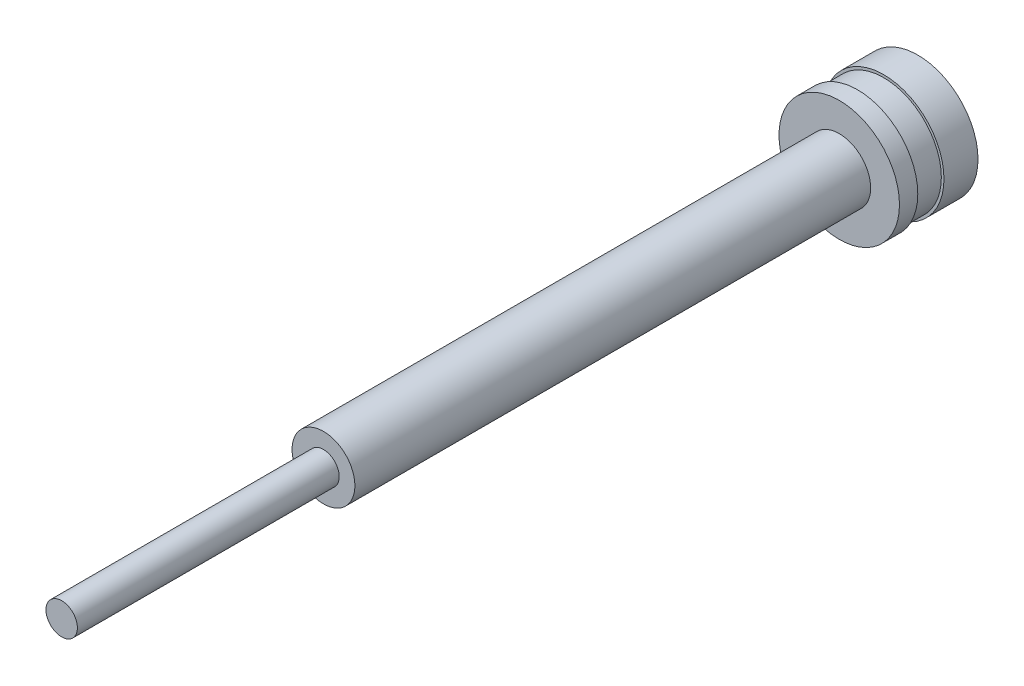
ISO-10303-21;
HEADER;
FILE_DESCRIPTION(('STEP AP214'),'2;1');
FILE_NAME('part.step','',(''),(''),'','','');
FILE_SCHEMA(('AUTOMOTIVE_DESIGN { 1 0 10303 214 1 1 1 1 }'));
ENDSEC;
DATA;
#1=APPLICATION_CONTEXT('core data for automotive mechanical design processes');
#2=APPLICATION_PROTOCOL_DEFINITION('international standard','automotive_design',2000,#1);
#3=PRODUCT_CONTEXT('',#1,'mechanical');
#4=PRODUCT('Part','Part','',(#3));
#5=PRODUCT_RELATED_PRODUCT_CATEGORY('part','',(#4));
#6=PRODUCT_DEFINITION_FORMATION('','',#4);
#7=PRODUCT_DEFINITION_CONTEXT('part definition',#1,'design');
#8=PRODUCT_DEFINITION('design','',#6,#7);
#9=PRODUCT_DEFINITION_SHAPE('','',#8);
#10=(LENGTH_UNIT() NAMED_UNIT(*) SI_UNIT(.MILLI.,.METRE.));
#11=(NAMED_UNIT(*) PLANE_ANGLE_UNIT() SI_UNIT($,.RADIAN.));
#12=(NAMED_UNIT(*) SI_UNIT($,.STERADIAN.) SOLID_ANGLE_UNIT());
#13=UNCERTAINTY_MEASURE_WITH_UNIT(LENGTH_MEASURE(1.E-05),#10,'distance_accuracy_value','');
#14=(GEOMETRIC_REPRESENTATION_CONTEXT(3) GLOBAL_UNCERTAINTY_ASSIGNED_CONTEXT((#13)) GLOBAL_UNIT_ASSIGNED_CONTEXT((#10,
#11,#12)) REPRESENTATION_CONTEXT('',''));
#15=CARTESIAN_POINT('',(0.,0.,0.));
#16=DIRECTION('',(0.,0.,1.));
#17=DIRECTION('',(1.,0.,0.));
#18=AXIS2_PLACEMENT_3D('',#15,#16,#17);
#19=CARTESIAN_POINT('',(0.,0.,0.));
#20=DIRECTION('',(0.,0.,-0.999999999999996));
#21=DIRECTION('',(-1.,0.,0.));
#22=AXIS2_PLACEMENT_3D('',#19,#20,#21);
#23=PLANE('',#22);
#24=CARTESIAN_POINT('',(0.,0.,0.));
#25=DIRECTION('',(0.,0.,0.999999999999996));
#26=DIRECTION('',(1.,0.,0.));
#27=AXIS2_PLACEMENT_3D('',#24,#25,#26);
#28=CIRCLE('',#27,3.);
#29=CARTESIAN_POINT('',(3.,0.,0.));
#30=VERTEX_POINT('',#29);
#31=EDGE_CURVE('E10',#30,#30,#28,.T.);
#32=ORIENTED_EDGE('',*,*,#31,.T.);
#33=EDGE_LOOP('',(#32));
#34=FACE_BOUND('',#33,.T.);
#35=ADVANCED_FACE('F38',(#34),#23,.F.);
#36=CARTESIAN_POINT('',(0.,0.,41.0720747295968));
#37=DIRECTION('',(0.,0.,0.999999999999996));
#38=DIRECTION('',(1.,0.,0.));
#39=AXIS2_PLACEMENT_3D('',#36,#37,#38);
#40=CYLINDRICAL_SURFACE('',#39,3.);
#41=CARTESIAN_POINT('',(0.,0.,-50.));
#42=DIRECTION('',(0.,0.,0.999999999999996));
#43=DIRECTION('',(1.,0.,0.));
#44=AXIS2_PLACEMENT_3D('',#41,#42,#43);
#45=CIRCLE('',#44,3.);
#46=CARTESIAN_POINT('',(3.,0.,-50.));
#47=VERTEX_POINT('',#46);
#48=EDGE_CURVE('E45',#47,#47,#45,.T.);
#49=CARTESIAN_POINT('',(3.,0.,0.));
#50=CARTESIAN_POINT('',(3.,0.,-0.520833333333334));
#51=CARTESIAN_POINT('',(3.,0.,-1.04166666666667));
#52=CARTESIAN_POINT('',(3.,0.,-2.08333333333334));
#53=CARTESIAN_POINT('',(3.,0.,-2.60416666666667));
#54=CARTESIAN_POINT('',(3.,0.,-3.64583333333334));
#55=CARTESIAN_POINT('',(3.,0.,-4.16666666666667));
#56=CARTESIAN_POINT('',(3.,0.,-5.20833333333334));
#57=CARTESIAN_POINT('',(3.,0.,-5.72916666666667));
#58=CARTESIAN_POINT('',(3.,0.,-6.77083333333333));
#59=CARTESIAN_POINT('',(3.,0.,-7.29166666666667));
#60=CARTESIAN_POINT('',(3.,0.,-8.33333333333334));
#61=CARTESIAN_POINT('',(3.,0.,-8.85416666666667));
#62=CARTESIAN_POINT('',(3.,0.,-9.89583333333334));
#63=CARTESIAN_POINT('',(3.,0.,-10.4166666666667));
#64=CARTESIAN_POINT('',(3.,0.,-11.4583333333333));
#65=CARTESIAN_POINT('',(3.,0.,-11.9791666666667));
#66=CARTESIAN_POINT('',(3.,0.,-13.0208333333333));
#67=CARTESIAN_POINT('',(3.,0.,-13.5416666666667));
#68=CARTESIAN_POINT('',(3.,0.,-14.5833333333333));
#69=CARTESIAN_POINT('',(3.,0.,-15.1041666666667));
#70=CARTESIAN_POINT('',(3.,0.,-16.1458333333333));
#71=CARTESIAN_POINT('',(3.,0.,-16.6666666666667));
#72=CARTESIAN_POINT('',(3.,0.,-17.7083333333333));
#73=CARTESIAN_POINT('',(3.,0.,-18.2291666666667));
#74=CARTESIAN_POINT('',(3.,0.,-19.2708333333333));
#75=CARTESIAN_POINT('',(3.,0.,-19.7916666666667));
#76=CARTESIAN_POINT('',(3.,0.,-20.8333333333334));
#77=CARTESIAN_POINT('',(3.,0.,-21.3541666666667));
#78=CARTESIAN_POINT('',(3.,0.,-22.3958333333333));
#79=CARTESIAN_POINT('',(3.,0.,-22.9166666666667));
#80=CARTESIAN_POINT('',(3.,0.,-23.9583333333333));
#81=CARTESIAN_POINT('',(3.,0.,-24.4791666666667));
#82=CARTESIAN_POINT('',(3.,0.,-25.5208333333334));
#83=CARTESIAN_POINT('',(3.,0.,-26.0416666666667));
#84=CARTESIAN_POINT('',(3.,0.,-27.0833333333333));
#85=CARTESIAN_POINT('',(3.,0.,-27.6041666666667));
#86=CARTESIAN_POINT('',(3.,0.,-28.6458333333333));
#87=CARTESIAN_POINT('',(3.,0.,-29.1666666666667));
#88=CARTESIAN_POINT('',(3.,0.,-30.2083333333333));
#89=CARTESIAN_POINT('',(3.,0.,-30.7291666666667));
#90=CARTESIAN_POINT('',(3.,0.,-31.7708333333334));
#91=CARTESIAN_POINT('',(3.,0.,-32.2916666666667));
#92=CARTESIAN_POINT('',(3.,0.,-33.3333333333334));
#93=CARTESIAN_POINT('',(3.,0.,-33.8541666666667));
#94=CARTESIAN_POINT('',(3.,0.,-34.8958333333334));
#95=CARTESIAN_POINT('',(3.,0.,-35.4166666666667));
#96=CARTESIAN_POINT('',(3.,0.,-36.4583333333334));
#97=CARTESIAN_POINT('',(3.,0.,-36.9791666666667));
#98=CARTESIAN_POINT('',(3.,0.,-38.0208333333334));
#99=CARTESIAN_POINT('',(3.,0.,-38.5416666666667));
#100=CARTESIAN_POINT('',(3.,0.,-39.5833333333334));
#101=CARTESIAN_POINT('',(3.,0.,-40.1041666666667));
#102=CARTESIAN_POINT('',(3.,0.,-41.1458333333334));
#103=CARTESIAN_POINT('',(3.,0.,-41.6666666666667));
#104=CARTESIAN_POINT('',(3.,0.,-42.7083333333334));
#105=CARTESIAN_POINT('',(3.,0.,-43.2291666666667));
#106=CARTESIAN_POINT('',(3.,0.,-44.2708333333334));
#107=CARTESIAN_POINT('',(3.,0.,-44.7916666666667));
#108=CARTESIAN_POINT('',(3.,0.,-45.8333333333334));
#109=CARTESIAN_POINT('',(3.,0.,-46.3541666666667));
#110=CARTESIAN_POINT('',(3.,0.,-47.3958333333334));
#111=CARTESIAN_POINT('',(3.,0.,-47.9166666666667));
#112=CARTESIAN_POINT('',(3.,0.,-48.9583333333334));
#113=CARTESIAN_POINT('',(3.,0.,-49.4791666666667));
#114=CARTESIAN_POINT('',(3.,0.,-50.));
#115=B_SPLINE_CURVE_WITH_KNOTS('',3,(#49,#50,#51,#52,#53,#54,#55,#56,#57,#58,#59,#60,#61,#62,
#63,#64,#65,#66,#67,#68,#69,#70,#71,#72,#73,#74,#75,#76,#77,#78,#79,#80,#81,#82,#83,#84,#85,#86,
#87,#88,#89,#90,#91,#92,#93,#94,#95,#96,#97,#98,#99,#100,#101,#102,#103,#104,#105,#106,#107,
#108,#109,#110,#111,#112,#113,#114),.UNSPECIFIED.,.F.,.F.,(4,2,2,2,2,2,2,2,2,2,2,2,2,2,2,2,2,2,
2,2,2,2,2,2,2,2,2,2,2,2,2,2,4),(0.,1.5625,3.125,4.6875,6.25,7.8125,9.37500000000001,10.9375,
12.5,14.0625,15.625,17.1875,18.75,20.3125,21.875,23.4375,25.,26.5625,28.125,29.6875,31.25,
32.8125,34.375,35.9375,37.5,39.0625,40.625,42.1875,43.75,45.3125,46.875,48.4375,50.),.UNSPECIFIED.);
#116=EDGE_CURVE('BSEAM102',#30,#47,#115,.T.);
#117=ORIENTED_EDGE('',*,*,#31,.F.);
#118=ORIENTED_EDGE('',*,*,#48,.T.);
#119=ORIENTED_EDGE('',*,*,#116,.T.);
#120=ORIENTED_EDGE('',*,*,#116,.F.);
#121=EDGE_LOOP('',(#117,#119,#118,#120));
#122=FACE_BOUND('',#121,.T.);
#123=ADVANCED_FACE('F102',(#122),#40,.T.);
#124=CARTESIAN_POINT('',(0.,3.,-50.));
#125=DIRECTION('',(0.,0.,-0.999999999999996));
#126=DIRECTION('',(-1.,0.,0.));
#127=AXIS2_PLACEMENT_3D('',#124,#125,#126);
#128=PLANE('',#127);
#129=ORIENTED_EDGE('',*,*,#48,.F.);
#130=EDGE_LOOP('',(#129));
#131=FACE_BOUND('',#130,.T.);
#132=CARTESIAN_POINT('',(0.,0.,-50.));
#133=DIRECTION('',(0.,0.,0.999999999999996));
#134=DIRECTION('',(1.,0.,0.));
#135=AXIS2_PLACEMENT_3D('',#132,#133,#134);
#136=CIRCLE('',#135,6.);
#137=CARTESIAN_POINT('',(6.,0.,-50.));
#138=VERTEX_POINT('',#137);
#139=EDGE_CURVE('E52',#138,#138,#136,.T.);
#140=ORIENTED_EDGE('',*,*,#139,.T.);
#141=EDGE_LOOP('',(#140));
#142=FACE_BOUND('',#141,.T.);
#143=ADVANCED_FACE('F106',(#131,#142),#128,.F.);
#144=CARTESIAN_POINT('',(0.,0.,41.0720747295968));
#145=DIRECTION('',(0.,0.,0.999999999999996));
#146=DIRECTION('',(1.,0.,0.));
#147=AXIS2_PLACEMENT_3D('',#144,#145,#146);
#148=CYLINDRICAL_SURFACE('',#147,6.);
#149=CARTESIAN_POINT('',(-9.43689570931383E-13,1.88737914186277E-12,-148.5));
#150=DIRECTION('',(0.,0.,0.999999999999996));
#151=DIRECTION('',(1.,0.,0.));
#152=AXIS2_PLACEMENT_3D('',#149,#150,#151);
#153=CIRCLE('',#152,6.);
#154=CARTESIAN_POINT('',(6.,0.,-148.5));
#155=VERTEX_POINT('',#154);
#156=EDGE_CURVE('E58',#155,#155,#153,.T.);
#157=CARTESIAN_POINT('',(6.,0.,-50.));
#158=CARTESIAN_POINT('',(6.,0.,-51.0260416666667));
#159=CARTESIAN_POINT('',(6.,0.,-52.0520833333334));
#160=CARTESIAN_POINT('',(6.,0.,-54.1041666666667));
#161=CARTESIAN_POINT('',(6.,0.,-55.1302083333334));
#162=CARTESIAN_POINT('',(6.,0.,-57.1822916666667));
#163=CARTESIAN_POINT('',(6.,0.,-58.2083333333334));
#164=CARTESIAN_POINT('',(6.,0.,-60.2604166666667));
#165=CARTESIAN_POINT('',(6.,0.,-61.2864583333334));
#166=CARTESIAN_POINT('',(6.,0.,-63.3385416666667));
#167=CARTESIAN_POINT('',(6.,0.,-64.3645833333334));
#168=CARTESIAN_POINT('',(6.,0.,-66.4166666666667));
#169=CARTESIAN_POINT('',(6.,0.,-67.4427083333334));
#170=CARTESIAN_POINT('',(6.,0.,-69.4947916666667));
#171=CARTESIAN_POINT('',(6.,0.,-70.5208333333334));
#172=CARTESIAN_POINT('',(6.,0.,-72.5729166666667));
#173=CARTESIAN_POINT('',(6.,0.,-73.5989583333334));
#174=CARTESIAN_POINT('',(6.,0.,-75.6510416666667));
#175=CARTESIAN_POINT('',(6.,0.,-76.6770833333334));
#176=CARTESIAN_POINT('',(6.,0.,-78.7291666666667));
#177=CARTESIAN_POINT('',(6.,0.,-79.7552083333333));
#178=CARTESIAN_POINT('',(6.,0.,-81.8072916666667));
#179=CARTESIAN_POINT('',(6.,0.,-82.8333333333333));
#180=CARTESIAN_POINT('',(6.,0.,-84.8854166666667));
#181=CARTESIAN_POINT('',(6.,0.,-85.9114583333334));
#182=CARTESIAN_POINT('',(6.,0.,-87.9635416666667));
#183=CARTESIAN_POINT('',(6.,0.,-88.9895833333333));
#184=CARTESIAN_POINT('',(6.,0.,-91.0416666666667));
#185=CARTESIAN_POINT('',(6.,0.,-92.0677083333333));
#186=CARTESIAN_POINT('',(6.,0.,-94.1197916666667));
#187=CARTESIAN_POINT('',(6.,0.,-95.1458333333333));
#188=CARTESIAN_POINT('',(6.,0.,-97.1979166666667));
#189=CARTESIAN_POINT('',(6.,0.,-98.2239583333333));
#190=CARTESIAN_POINT('',(6.,0.,-100.276041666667));
#191=CARTESIAN_POINT('',(6.,0.,-101.302083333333));
#192=CARTESIAN_POINT('',(6.,0.,-103.354166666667));
#193=CARTESIAN_POINT('',(6.,0.,-104.380208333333));
#194=CARTESIAN_POINT('',(6.,0.,-106.432291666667));
#195=CARTESIAN_POINT('',(6.,0.,-107.458333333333));
#196=CARTESIAN_POINT('',(6.,0.,-109.510416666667));
#197=CARTESIAN_POINT('',(6.,0.,-110.536458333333));
#198=CARTESIAN_POINT('',(6.,0.,-112.588541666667));
#199=CARTESIAN_POINT('',(6.,0.,-113.614583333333));
#200=CARTESIAN_POINT('',(6.,0.,-115.666666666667));
#201=CARTESIAN_POINT('',(6.,0.,-116.692708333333));
#202=CARTESIAN_POINT('',(6.,0.,-118.744791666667));
#203=CARTESIAN_POINT('',(6.,0.,-119.770833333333));
#204=CARTESIAN_POINT('',(6.,0.,-121.822916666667));
#205=CARTESIAN_POINT('',(6.,0.,-122.848958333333));
#206=CARTESIAN_POINT('',(6.,0.,-124.901041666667));
#207=CARTESIAN_POINT('',(6.,0.,-125.927083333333));
#208=CARTESIAN_POINT('',(6.,0.,-127.979166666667));
#209=CARTESIAN_POINT('',(6.,0.,-129.005208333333));
#210=CARTESIAN_POINT('',(6.,0.,-131.057291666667));
#211=CARTESIAN_POINT('',(6.,0.,-132.083333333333));
#212=CARTESIAN_POINT('',(6.,0.,-134.135416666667));
#213=CARTESIAN_POINT('',(6.,0.,-135.161458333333));
#214=CARTESIAN_POINT('',(6.,0.,-137.213541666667));
#215=CARTESIAN_POINT('',(6.,0.,-138.239583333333));
#216=CARTESIAN_POINT('',(6.,0.,-140.291666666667));
#217=CARTESIAN_POINT('',(6.,0.,-141.317708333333));
#218=CARTESIAN_POINT('',(6.,0.,-143.369791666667));
#219=CARTESIAN_POINT('',(6.,0.,-144.395833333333));
#220=CARTESIAN_POINT('',(6.,0.,-146.447916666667));
#221=CARTESIAN_POINT('',(6.,0.,-147.473958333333));
#222=CARTESIAN_POINT('',(6.,0.,-148.5));
#223=B_SPLINE_CURVE_WITH_KNOTS('',3,(#157,#158,#159,#160,#161,#162,#163,#164,#165,#166,#167,
#168,#169,#170,#171,#172,#173,#174,#175,#176,#177,#178,#179,#180,#181,#182,#183,#184,#185,#186,
#187,#188,#189,#190,#191,#192,#193,#194,#195,#196,#197,#198,#199,#200,#201,#202,#203,#204,#205,
#206,#207,#208,#209,#210,#211,#212,#213,#214,#215,#216,#217,#218,#219,#220,#221,#222),
.UNSPECIFIED.,.F.,.F.,(4,2,2,2,2,2,2,2,2,2,2,2,2,2,2,2,2,2,2,2,2,2,2,2,2,2,2,2,2,2,2,2,4),(0.,
3.078125,6.15625,9.234375,12.3125,15.390625,18.46875,21.546875,24.625,27.703125,30.78125,
33.859375,36.9375,40.015625,43.09375,46.171875,49.25,52.328125,55.40625,58.484375,61.5625,
64.640625,67.71875,70.7968749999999,73.875,76.9531249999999,80.03125,83.1093749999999,86.1875,
89.2656249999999,92.3437499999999,95.4218749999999,98.4999999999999),.UNSPECIFIED.);
#224=EDGE_CURVE('BSEAM111',#138,#155,#223,.T.);
#225=ORIENTED_EDGE('',*,*,#139,.F.);
#226=ORIENTED_EDGE('',*,*,#156,.T.);
#227=ORIENTED_EDGE('',*,*,#224,.T.);
#228=ORIENTED_EDGE('',*,*,#224,.F.);
#229=EDGE_LOOP('',(#225,#227,#226,#228));
#230=FACE_BOUND('',#229,.T.);
#231=ADVANCED_FACE('F111',(#230),#148,.T.);
#232=CARTESIAN_POINT('',(-9.43689570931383E-13,6.00000000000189,-148.5));
#233=DIRECTION('',(0.,0.,-0.999999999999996));
#234=DIRECTION('',(-1.,0.,0.));
#235=AXIS2_PLACEMENT_3D('',#232,#233,#234);
#236=PLANE('',#235);
#237=ORIENTED_EDGE('',*,*,#156,.F.);
#238=EDGE_LOOP('',(#237));
#239=FACE_BOUND('',#238,.T.);
#240=CARTESIAN_POINT('',(-9.43689570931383E-13,1.88737914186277E-12,-148.5));
#241=DIRECTION('',(0.,0.,0.999999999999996));
#242=DIRECTION('',(1.,0.,0.));
#243=AXIS2_PLACEMENT_3D('',#240,#241,#242);
#244=CIRCLE('',#243,11.5);
#245=CARTESIAN_POINT('',(11.5,0.,-148.5));
#246=VERTEX_POINT('',#245);
#247=EDGE_CURVE('E64',#246,#246,#244,.T.);
#248=ORIENTED_EDGE('',*,*,#247,.T.);
#249=EDGE_LOOP('',(#248));
#250=FACE_BOUND('',#249,.T.);
#251=ADVANCED_FACE('F117',(#239,#250),#236,.F.);
#252=CARTESIAN_POINT('',(0.,0.,41.0720747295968));
#253=DIRECTION('',(0.,0.,0.999999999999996));
#254=DIRECTION('',(1.,0.,0.));
#255=AXIS2_PLACEMENT_3D('',#252,#253,#254);
#256=CYLINDRICAL_SURFACE('',#255,11.5);
#257=CARTESIAN_POINT('',(0.,1.88737914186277E-12,-152.));
#258=DIRECTION('',(0.,0.,0.999999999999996));
#259=DIRECTION('',(1.,0.,0.));
#260=AXIS2_PLACEMENT_3D('',#257,#258,#259);
#261=CIRCLE('',#260,11.5);
#262=CARTESIAN_POINT('',(11.5,0.,-152.));
#263=VERTEX_POINT('',#262);
#264=EDGE_CURVE('E68',#263,#263,#261,.T.);
#265=CARTESIAN_POINT('',(11.5,0.,-148.5));
#266=CARTESIAN_POINT('',(11.5,0.,-148.536458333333));
#267=CARTESIAN_POINT('',(11.5,0.,-148.572916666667));
#268=CARTESIAN_POINT('',(11.5,0.,-148.645833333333));
#269=CARTESIAN_POINT('',(11.5,0.,-148.682291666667));
#270=CARTESIAN_POINT('',(11.5,0.,-148.755208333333));
#271=CARTESIAN_POINT('',(11.5,0.,-148.791666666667));
#272=CARTESIAN_POINT('',(11.5,0.,-148.864583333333));
#273=CARTESIAN_POINT('',(11.5,0.,-148.901041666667));
#274=CARTESIAN_POINT('',(11.5,0.,-148.973958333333));
#275=CARTESIAN_POINT('',(11.5,0.,-149.010416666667));
#276=CARTESIAN_POINT('',(11.5,0.,-149.083333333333));
#277=CARTESIAN_POINT('',(11.5,0.,-149.119791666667));
#278=CARTESIAN_POINT('',(11.5,0.,-149.192708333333));
#279=CARTESIAN_POINT('',(11.5,0.,-149.229166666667));
#280=CARTESIAN_POINT('',(11.5,0.,-149.302083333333));
#281=CARTESIAN_POINT('',(11.5,0.,-149.338541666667));
#282=CARTESIAN_POINT('',(11.5,0.,-149.411458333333));
#283=CARTESIAN_POINT('',(11.5,0.,-149.447916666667));
#284=CARTESIAN_POINT('',(11.5,0.,-149.520833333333));
#285=CARTESIAN_POINT('',(11.5,0.,-149.557291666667));
#286=CARTESIAN_POINT('',(11.5,0.,-149.630208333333));
#287=CARTESIAN_POINT('',(11.5,0.,-149.666666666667));
#288=CARTESIAN_POINT('',(11.5,0.,-149.739583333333));
#289=CARTESIAN_POINT('',(11.5,0.,-149.776041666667));
#290=CARTESIAN_POINT('',(11.5,0.,-149.848958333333));
#291=CARTESIAN_POINT('',(11.5,0.,-149.885416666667));
#292=CARTESIAN_POINT('',(11.5,0.,-149.958333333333));
#293=CARTESIAN_POINT('',(11.5,0.,-149.994791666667));
#294=CARTESIAN_POINT('',(11.5,0.,-150.067708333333));
#295=CARTESIAN_POINT('',(11.5,0.,-150.104166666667));
#296=CARTESIAN_POINT('',(11.5,0.,-150.177083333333));
#297=CARTESIAN_POINT('',(11.5,0.,-150.213541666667));
#298=CARTESIAN_POINT('',(11.5,0.,-150.286458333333));
#299=CARTESIAN_POINT('',(11.5,0.,-150.322916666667));
#300=CARTESIAN_POINT('',(11.5,0.,-150.395833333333));
#301=CARTESIAN_POINT('',(11.5,0.,-150.432291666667));
#302=CARTESIAN_POINT('',(11.5,0.,-150.505208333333));
#303=CARTESIAN_POINT('',(11.5,0.,-150.541666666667));
#304=CARTESIAN_POINT('',(11.5,0.,-150.614583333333));
#305=CARTESIAN_POINT('',(11.5,0.,-150.651041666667));
#306=CARTESIAN_POINT('',(11.5,0.,-150.723958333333));
#307=CARTESIAN_POINT('',(11.5,0.,-150.760416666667));
#308=CARTESIAN_POINT('',(11.5,0.,-150.833333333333));
#309=CARTESIAN_POINT('',(11.5,0.,-150.869791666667));
#310=CARTESIAN_POINT('',(11.5,0.,-150.942708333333));
#311=CARTESIAN_POINT('',(11.5,0.,-150.979166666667));
#312=CARTESIAN_POINT('',(11.5,0.,-151.052083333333));
#313=CARTESIAN_POINT('',(11.5,0.,-151.088541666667));
#314=CARTESIAN_POINT('',(11.5,0.,-151.161458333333));
#315=CARTESIAN_POINT('',(11.5,0.,-151.197916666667));
#316=CARTESIAN_POINT('',(11.5,0.,-151.270833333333));
#317=CARTESIAN_POINT('',(11.5,0.,-151.307291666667));
#318=CARTESIAN_POINT('',(11.5,0.,-151.380208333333));
#319=CARTESIAN_POINT('',(11.5,0.,-151.416666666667));
#320=CARTESIAN_POINT('',(11.5,0.,-151.489583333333));
#321=CARTESIAN_POINT('',(11.5,0.,-151.526041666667));
#322=CARTESIAN_POINT('',(11.5,0.,-151.598958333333));
#323=CARTESIAN_POINT('',(11.5,0.,-151.635416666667));
#324=CARTESIAN_POINT('',(11.5,0.,-151.708333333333));
#325=CARTESIAN_POINT('',(11.5,0.,-151.744791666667));
#326=CARTESIAN_POINT('',(11.5,0.,-151.817708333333));
#327=CARTESIAN_POINT('',(11.5,0.,-151.854166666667));
#328=CARTESIAN_POINT('',(11.5,0.,-151.927083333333));
#329=CARTESIAN_POINT('',(11.5,0.,-151.963541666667));
#330=CARTESIAN_POINT('',(11.5,0.,-152.));
#331=B_SPLINE_CURVE_WITH_KNOTS('',3,(#265,#266,#267,#268,#269,#270,#271,#272,#273,#274,#275,
#276,#277,#278,#279,#280,#281,#282,#283,#284,#285,#286,#287,#288,#289,#290,#291,#292,#293,#294,
#295,#296,#297,#298,#299,#300,#301,#302,#303,#304,#305,#306,#307,#308,#309,#310,#311,#312,#313,
#314,#315,#316,#317,#318,#319,#320,#321,#322,#323,#324,#325,#326,#327,#328,#329,#330),
.UNSPECIFIED.,.F.,.F.,(4,2,2,2,2,2,2,2,2,2,2,2,2,2,2,2,2,2,2,2,2,2,2,2,2,2,2,2,2,2,2,2,4),(0.,
0.109374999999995,0.21874999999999,0.328124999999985,0.43749999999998,0.546875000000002,
0.656249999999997,0.765624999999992,0.874999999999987,0.984374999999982,1.09374999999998,
1.20312499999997,1.31249999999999,1.42187499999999,1.53124999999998,1.64062499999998,
1.74999999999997,1.85937499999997,1.96874999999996,2.07812499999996,2.18749999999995,
2.29687499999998,2.40624999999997,2.51562499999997,2.62499999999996,2.73437499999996,
2.84374999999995,2.95312499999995,3.06249999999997,3.17187499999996,3.28124999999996,
3.39062499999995,3.49999999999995),.UNSPECIFIED.);
#332=EDGE_CURVE('BSEAM121',#246,#263,#331,.T.);
#333=ORIENTED_EDGE('',*,*,#247,.F.);
#334=ORIENTED_EDGE('',*,*,#264,.T.);
#335=ORIENTED_EDGE('',*,*,#332,.T.);
#336=ORIENTED_EDGE('',*,*,#332,.F.);
#337=EDGE_LOOP('',(#333,#335,#334,#336));
#338=FACE_BOUND('',#337,.T.);
#339=ADVANCED_FACE('F121',(#338),#256,.T.);
#340=CARTESIAN_POINT('',(0.,11.5000000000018,-152.));
#341=DIRECTION('',(0.,0.,0.999999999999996));
#342=DIRECTION('',(1.,0.,0.));
#343=AXIS2_PLACEMENT_3D('',#340,#341,#342);
#344=PLANE('',#343);
#345=ORIENTED_EDGE('',*,*,#264,.F.);
#346=EDGE_LOOP('',(#345));
#347=FACE_BOUND('',#346,.T.);
#348=CARTESIAN_POINT('',(0.,1.88737914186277E-12,-152.));
#349=DIRECTION('',(0.,0.,0.999999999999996));
#350=DIRECTION('',(1.,0.,0.));
#351=AXIS2_PLACEMENT_3D('',#348,#349,#350);
#352=CIRCLE('',#351,11.);
#353=CARTESIAN_POINT('',(11.,0.,-152.));
#354=VERTEX_POINT('',#353);
#355=EDGE_CURVE('E72',#354,#354,#352,.T.);
#356=ORIENTED_EDGE('',*,*,#355,.T.);
#357=EDGE_LOOP('',(#356));
#358=FACE_BOUND('',#357,.T.);
#359=ADVANCED_FACE('F125',(#347,#358),#344,.F.);
#360=CARTESIAN_POINT('',(0.,0.,41.0720747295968));
#361=DIRECTION('',(0.,0.,0.999999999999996));
#362=DIRECTION('',(1.,0.,0.));
#363=AXIS2_PLACEMENT_3D('',#360,#361,#362);
#364=CYLINDRICAL_SURFACE('',#363,11.);
#365=CARTESIAN_POINT('',(0.,1.88737914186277E-12,-157.));
#366=DIRECTION('',(0.,0.,0.999999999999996));
#367=DIRECTION('',(1.,0.,0.));
#368=AXIS2_PLACEMENT_3D('',#365,#366,#367);
#369=CIRCLE('',#368,11.);
#370=CARTESIAN_POINT('',(11.,0.,-157.));
#371=VERTEX_POINT('',#370);
#372=EDGE_CURVE('E76',#371,#371,#369,.T.);
#373=CARTESIAN_POINT('',(11.,0.,-152.));
#374=CARTESIAN_POINT('',(11.,0.,-152.052083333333));
#375=CARTESIAN_POINT('',(11.,0.,-152.104166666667));
#376=CARTESIAN_POINT('',(11.,0.,-152.208333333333));
#377=CARTESIAN_POINT('',(11.,0.,-152.260416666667));
#378=CARTESIAN_POINT('',(11.,0.,-152.364583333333));
#379=CARTESIAN_POINT('',(11.,0.,-152.416666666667));
#380=CARTESIAN_POINT('',(11.,0.,-152.520833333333));
#381=CARTESIAN_POINT('',(11.,0.,-152.572916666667));
#382=CARTESIAN_POINT('',(11.,0.,-152.677083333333));
#383=CARTESIAN_POINT('',(11.,0.,-152.729166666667));
#384=CARTESIAN_POINT('',(11.,0.,-152.833333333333));
#385=CARTESIAN_POINT('',(11.,0.,-152.885416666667));
#386=CARTESIAN_POINT('',(11.,0.,-152.989583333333));
#387=CARTESIAN_POINT('',(11.,0.,-153.041666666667));
#388=CARTESIAN_POINT('',(11.,0.,-153.145833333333));
#389=CARTESIAN_POINT('',(11.,0.,-153.197916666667));
#390=CARTESIAN_POINT('',(11.,0.,-153.302083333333));
#391=CARTESIAN_POINT('',(11.,0.,-153.354166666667));
#392=CARTESIAN_POINT('',(11.,0.,-153.458333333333));
#393=CARTESIAN_POINT('',(11.,0.,-153.510416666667));
#394=CARTESIAN_POINT('',(11.,0.,-153.614583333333));
#395=CARTESIAN_POINT('',(11.,0.,-153.666666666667));
#396=CARTESIAN_POINT('',(11.,0.,-153.770833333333));
#397=CARTESIAN_POINT('',(11.,0.,-153.822916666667));
#398=CARTESIAN_POINT('',(11.,0.,-153.927083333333));
#399=CARTESIAN_POINT('',(11.,0.,-153.979166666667));
#400=CARTESIAN_POINT('',(11.,0.,-154.083333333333));
#401=CARTESIAN_POINT('',(11.,0.,-154.135416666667));
#402=CARTESIAN_POINT('',(11.,0.,-154.239583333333));
#403=CARTESIAN_POINT('',(11.,0.,-154.291666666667));
#404=CARTESIAN_POINT('',(11.,0.,-154.395833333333));
#405=CARTESIAN_POINT('',(11.,0.,-154.447916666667));
#406=CARTESIAN_POINT('',(11.,0.,-154.552083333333));
#407=CARTESIAN_POINT('',(11.,0.,-154.604166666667));
#408=CARTESIAN_POINT('',(11.,0.,-154.708333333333));
#409=CARTESIAN_POINT('',(11.,0.,-154.760416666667));
#410=CARTESIAN_POINT('',(11.,0.,-154.864583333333));
#411=CARTESIAN_POINT('',(11.,0.,-154.916666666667));
#412=CARTESIAN_POINT('',(11.,0.,-155.020833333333));
#413=CARTESIAN_POINT('',(11.,0.,-155.072916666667));
#414=CARTESIAN_POINT('',(11.,0.,-155.177083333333));
#415=CARTESIAN_POINT('',(11.,0.,-155.229166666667));
#416=CARTESIAN_POINT('',(11.,0.,-155.333333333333));
#417=CARTESIAN_POINT('',(11.,0.,-155.385416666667));
#418=CARTESIAN_POINT('',(11.,0.,-155.489583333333));
#419=CARTESIAN_POINT('',(11.,0.,-155.541666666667));
#420=CARTESIAN_POINT('',(11.,0.,-155.645833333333));
#421=CARTESIAN_POINT('',(11.,0.,-155.697916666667));
#422=CARTESIAN_POINT('',(11.,0.,-155.802083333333));
#423=CARTESIAN_POINT('',(11.,0.,-155.854166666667));
#424=CARTESIAN_POINT('',(11.,0.,-155.958333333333));
#425=CARTESIAN_POINT('',(11.,0.,-156.010416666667));
#426=CARTESIAN_POINT('',(11.,0.,-156.114583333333));
#427=CARTESIAN_POINT('',(11.,0.,-156.166666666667));
#428=CARTESIAN_POINT('',(11.,0.,-156.270833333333));
#429=CARTESIAN_POINT('',(11.,0.,-156.322916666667));
#430=CARTESIAN_POINT('',(11.,0.,-156.427083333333));
#431=CARTESIAN_POINT('',(11.,0.,-156.479166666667));
#432=CARTESIAN_POINT('',(11.,0.,-156.583333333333));
#433=CARTESIAN_POINT('',(11.,0.,-156.635416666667));
#434=CARTESIAN_POINT('',(11.,0.,-156.739583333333));
#435=CARTESIAN_POINT('',(11.,0.,-156.791666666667));
#436=CARTESIAN_POINT('',(11.,0.,-156.895833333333));
#437=CARTESIAN_POINT('',(11.,0.,-156.947916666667));
#438=CARTESIAN_POINT('',(11.,0.,-157.));
#439=B_SPLINE_CURVE_WITH_KNOTS('',3,(#373,#374,#375,#376,#377,#378,#379,#380,#381,#382,#383,
#384,#385,#386,#387,#388,#389,#390,#391,#392,#393,#394,#395,#396,#397,#398,#399,#400,#401,#402,
#403,#404,#405,#406,#407,#408,#409,#410,#411,#412,#413,#414,#415,#416,#417,#418,#419,#420,#421,
#422,#423,#424,#425,#426,#427,#428,#429,#430,#431,#432,#433,#434,#435,#436,#437,#438),
.UNSPECIFIED.,.F.,.F.,(4,2,2,2,2,2,2,2,2,2,2,2,2,2,2,2,2,2,2,2,2,2,2,2,2,2,2,2,2,2,2,2,4),(0.,
0.156249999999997,0.312499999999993,0.46874999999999,0.624999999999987,0.781250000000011,
0.937500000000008,1.09375,1.25,1.40625,1.56249999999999,1.71874999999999,1.87499999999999,
2.03124999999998,2.18749999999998,2.34374999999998,2.49999999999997,2.65624999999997,
2.81249999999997,2.96874999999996,3.12499999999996,3.28124999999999,3.43749999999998,
3.59374999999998,3.74999999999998,3.90624999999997,4.06249999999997,4.21874999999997,
4.37499999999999,4.53124999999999,4.68749999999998,4.84374999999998,4.99999999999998),.UNSPECIFIED.);
#440=EDGE_CURVE('BSEAM129',#354,#371,#439,.T.);
#441=ORIENTED_EDGE('',*,*,#355,.F.);
#442=ORIENTED_EDGE('',*,*,#372,.T.);
#443=ORIENTED_EDGE('',*,*,#440,.T.);
#444=ORIENTED_EDGE('',*,*,#440,.F.);
#445=EDGE_LOOP('',(#441,#443,#442,#444));
#446=FACE_BOUND('',#445,.T.);
#447=ADVANCED_FACE('F129',(#446),#364,.T.);
#448=CARTESIAN_POINT('',(0.,11.0000000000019,-157.));
#449=DIRECTION('',(0.,0.,-0.999999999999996));
#450=DIRECTION('',(-1.,0.,0.));
#451=AXIS2_PLACEMENT_3D('',#448,#449,#450);
#452=PLANE('',#451);
#453=ORIENTED_EDGE('',*,*,#372,.F.);
#454=EDGE_LOOP('',(#453));
#455=FACE_BOUND('',#454,.T.);
#456=CARTESIAN_POINT('',(0.,1.88737914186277E-12,-157.));
#457=DIRECTION('',(0.,0.,0.999999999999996));
#458=DIRECTION('',(1.,0.,0.));
#459=AXIS2_PLACEMENT_3D('',#456,#457,#458);
#460=CIRCLE('',#459,11.5);
#461=CARTESIAN_POINT('',(11.5,0.,-157.));
#462=VERTEX_POINT('',#461);
#463=EDGE_CURVE('E79',#462,#462,#460,.T.);
#464=ORIENTED_EDGE('',*,*,#463,.T.);
#465=EDGE_LOOP('',(#464));
#466=FACE_BOUND('',#465,.T.);
#467=ADVANCED_FACE('F133',(#455,#466),#452,.F.);
#468=CARTESIAN_POINT('',(0.,0.,41.0720747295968));
#469=DIRECTION('',(0.,0.,0.999999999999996));
#470=DIRECTION('',(1.,0.,0.));
#471=AXIS2_PLACEMENT_3D('',#468,#469,#470);
#472=CYLINDRICAL_SURFACE('',#471,11.5);
#473=CARTESIAN_POINT('',(-9.43689570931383E-13,1.88737914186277E-12,-163.5));
#474=DIRECTION('',(0.,0.,0.999999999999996));
#475=DIRECTION('',(1.,0.,0.));
#476=AXIS2_PLACEMENT_3D('',#473,#474,#475);
#477=CIRCLE('',#476,11.5);
#478=CARTESIAN_POINT('',(11.5,0.,-163.5));
#479=VERTEX_POINT('',#478);
#480=EDGE_CURVE('E82',#479,#479,#477,.T.);
#481=CARTESIAN_POINT('',(11.5,0.,-157.));
#482=CARTESIAN_POINT('',(11.5,0.,-157.067708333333));
#483=CARTESIAN_POINT('',(11.5,0.,-157.135416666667));
#484=CARTESIAN_POINT('',(11.5,0.,-157.270833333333));
#485=CARTESIAN_POINT('',(11.5,0.,-157.338541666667));
#486=CARTESIAN_POINT('',(11.5,0.,-157.473958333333));
#487=CARTESIAN_POINT('',(11.5,0.,-157.541666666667));
#488=CARTESIAN_POINT('',(11.5,0.,-157.677083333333));
#489=CARTESIAN_POINT('',(11.5,0.,-157.744791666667));
#490=CARTESIAN_POINT('',(11.5,0.,-157.880208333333));
#491=CARTESIAN_POINT('',(11.5,0.,-157.947916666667));
#492=CARTESIAN_POINT('',(11.5,0.,-158.083333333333));
#493=CARTESIAN_POINT('',(11.5,0.,-158.151041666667));
#494=CARTESIAN_POINT('',(11.5,0.,-158.286458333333));
#495=CARTESIAN_POINT('',(11.5,0.,-158.354166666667));
#496=CARTESIAN_POINT('',(11.5,0.,-158.489583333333));
#497=CARTESIAN_POINT('',(11.5,0.,-158.557291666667));
#498=CARTESIAN_POINT('',(11.5,0.,-158.692708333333));
#499=CARTESIAN_POINT('',(11.5,0.,-158.760416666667));
#500=CARTESIAN_POINT('',(11.5,0.,-158.895833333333));
#501=CARTESIAN_POINT('',(11.5,0.,-158.963541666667));
#502=CARTESIAN_POINT('',(11.5,0.,-159.098958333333));
#503=CARTESIAN_POINT('',(11.5,0.,-159.166666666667));
#504=CARTESIAN_POINT('',(11.5,0.,-159.302083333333));
#505=CARTESIAN_POINT('',(11.5,0.,-159.369791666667));
#506=CARTESIAN_POINT('',(11.5,0.,-159.505208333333));
#507=CARTESIAN_POINT('',(11.5,0.,-159.572916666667));
#508=CARTESIAN_POINT('',(11.5,0.,-159.708333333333));
#509=CARTESIAN_POINT('',(11.5,0.,-159.776041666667));
#510=CARTESIAN_POINT('',(11.5,0.,-159.911458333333));
#511=CARTESIAN_POINT('',(11.5,0.,-159.979166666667));
#512=CARTESIAN_POINT('',(11.5,0.,-160.114583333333));
#513=CARTESIAN_POINT('',(11.5,0.,-160.182291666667));
#514=CARTESIAN_POINT('',(11.5,0.,-160.317708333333));
#515=CARTESIAN_POINT('',(11.5,0.,-160.385416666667));
#516=CARTESIAN_POINT('',(11.5,0.,-160.520833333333));
#517=CARTESIAN_POINT('',(11.5,0.,-160.588541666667));
#518=CARTESIAN_POINT('',(11.5,0.,-160.723958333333));
#519=CARTESIAN_POINT('',(11.5,0.,-160.791666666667));
#520=CARTESIAN_POINT('',(11.5,0.,-160.927083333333));
#521=CARTESIAN_POINT('',(11.5,0.,-160.994791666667));
#522=CARTESIAN_POINT('',(11.5,0.,-161.130208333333));
#523=CARTESIAN_POINT('',(11.5,0.,-161.197916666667));
#524=CARTESIAN_POINT('',(11.5,0.,-161.333333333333));
#525=CARTESIAN_POINT('',(11.5,0.,-161.401041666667));
#526=CARTESIAN_POINT('',(11.5,0.,-161.536458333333));
#527=CARTESIAN_POINT('',(11.5,0.,-161.604166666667));
#528=CARTESIAN_POINT('',(11.5,0.,-161.739583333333));
#529=CARTESIAN_POINT('',(11.5,0.,-161.807291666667));
#530=CARTESIAN_POINT('',(11.5,0.,-161.942708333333));
#531=CARTESIAN_POINT('',(11.5,0.,-162.010416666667));
#532=CARTESIAN_POINT('',(11.5,0.,-162.145833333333));
#533=CARTESIAN_POINT('',(11.5,0.,-162.213541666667));
#534=CARTESIAN_POINT('',(11.5,0.,-162.348958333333));
#535=CARTESIAN_POINT('',(11.5,0.,-162.416666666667));
#536=CARTESIAN_POINT('',(11.5,0.,-162.552083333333));
#537=CARTESIAN_POINT('',(11.5,0.,-162.619791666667));
#538=CARTESIAN_POINT('',(11.5,0.,-162.755208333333));
#539=CARTESIAN_POINT('',(11.5,0.,-162.822916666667));
#540=CARTESIAN_POINT('',(11.5,0.,-162.958333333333));
#541=CARTESIAN_POINT('',(11.5,0.,-163.026041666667));
#542=CARTESIAN_POINT('',(11.5,0.,-163.161458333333));
#543=CARTESIAN_POINT('',(11.5,0.,-163.229166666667));
#544=CARTESIAN_POINT('',(11.5,0.,-163.364583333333));
#545=CARTESIAN_POINT('',(11.5,0.,-163.432291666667));
#546=CARTESIAN_POINT('',(11.5,0.,-163.5));
#547=B_SPLINE_CURVE_WITH_KNOTS('',3,(#481,#482,#483,#484,#485,#486,#487,#488,#489,#490,#491,
#492,#493,#494,#495,#496,#497,#498,#499,#500,#501,#502,#503,#504,#505,#506,#507,#508,#509,#510,
#511,#512,#513,#514,#515,#516,#517,#518,#519,#520,#521,#522,#523,#524,#525,#526,#527,#528,#529,
#530,#531,#532,#533,#534,#535,#536,#537,#538,#539,#540,#541,#542,#543,#544,#545,#546),
.UNSPECIFIED.,.F.,.F.,(4,2,2,2,2,2,2,2,2,2,2,2,2,2,2,2,2,2,2,2,2,2,2,2,2,2,2,2,2,2,2,2,4),(0.,
0.203124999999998,0.406249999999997,0.609375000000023,0.812500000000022,1.01562500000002,
1.21875000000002,1.42187500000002,1.62500000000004,1.82812500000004,2.03125000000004,
2.23437500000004,2.43750000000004,2.64062500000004,2.84375000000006,3.04687500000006,
3.25000000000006,3.45312500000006,3.65625000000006,3.85937500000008,4.06250000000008,
4.26562500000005,4.46875000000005,4.67187500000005,4.87500000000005,5.07812500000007,
5.28125000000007,5.48437500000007,5.68750000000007,5.89062500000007,6.09375000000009,
6.29687500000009,6.50000000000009),.UNSPECIFIED.);
#548=EDGE_CURVE('BSEAM98',#462,#479,#547,.T.);
#549=ORIENTED_EDGE('',*,*,#463,.F.);
#550=ORIENTED_EDGE('',*,*,#480,.T.);
#551=ORIENTED_EDGE('',*,*,#548,.T.);
#552=ORIENTED_EDGE('',*,*,#548,.F.);
#553=EDGE_LOOP('',(#549,#551,#550,#552));
#554=FACE_BOUND('',#553,.T.);
#555=ADVANCED_FACE('F98',(#554),#472,.T.);
#556=CARTESIAN_POINT('',(-9.43689570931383E-13,1.88737914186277E-12,-164.5));
#557=DIRECTION('',(0.,0.,0.999999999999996));
#558=DIRECTION('',(1.,0.,0.));
#559=AXIS2_PLACEMENT_3D('',#556,#557,#558);
#560=CONICAL_SURFACE('',#559,6.5,1.37340076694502);
#561=CARTESIAN_POINT('',(-9.43689570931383E-13,1.88737914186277E-12,-164.5));
#562=DIRECTION('',(0.,0.,0.999999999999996));
#563=DIRECTION('',(1.,0.,0.));
#564=AXIS2_PLACEMENT_3D('',#561,#562,#563);
#565=CIRCLE('',#564,6.5);
#566=CARTESIAN_POINT('',(6.49999999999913,1.88737914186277E-12,-164.5));
#567=VERTEX_POINT('',#566);
#568=EDGE_CURVE('E86',#567,#567,#565,.T.);
#569=CARTESIAN_POINT('',(11.4999999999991,1.88737914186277E-12,-163.5));
#570=CARTESIAN_POINT('',(11.4479166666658,1.88737914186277E-12,-163.510416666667));
#571=CARTESIAN_POINT('',(11.3958333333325,1.88737914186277E-12,-163.520833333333));
#572=CARTESIAN_POINT('',(11.2916666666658,1.88737914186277E-12,-163.541666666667));
#573=CARTESIAN_POINT('',(11.2395833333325,1.88737914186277E-12,-163.552083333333));
#574=CARTESIAN_POINT('',(11.1354166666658,1.88737914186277E-12,-163.572916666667));
#575=CARTESIAN_POINT('',(11.0833333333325,1.88737914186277E-12,-163.583333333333));
#576=CARTESIAN_POINT('',(10.9791666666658,1.88737914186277E-12,-163.604166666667));
#577=CARTESIAN_POINT('',(10.9270833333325,1.88737914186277E-12,-163.614583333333));
#578=CARTESIAN_POINT('',(10.8229166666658,1.88737914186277E-12,-163.635416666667));
#579=CARTESIAN_POINT('',(10.7708333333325,1.88737914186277E-12,-163.645833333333));
#580=CARTESIAN_POINT('',(10.6666666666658,1.88737914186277E-12,-163.666666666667));
#581=CARTESIAN_POINT('',(10.6145833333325,1.88737914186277E-12,-163.677083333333));
#582=CARTESIAN_POINT('',(10.5104166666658,1.88737914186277E-12,-163.697916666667));
#583=CARTESIAN_POINT('',(10.4583333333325,1.88737914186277E-12,-163.708333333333));
#584=CARTESIAN_POINT('',(10.3541666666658,1.88737914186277E-12,-163.729166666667));
#585=CARTESIAN_POINT('',(10.3020833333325,1.88737914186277E-12,-163.739583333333));
#586=CARTESIAN_POINT('',(10.1979166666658,1.88737914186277E-12,-163.760416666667));
#587=CARTESIAN_POINT('',(10.1458333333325,1.88737914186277E-12,-163.770833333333));
#588=CARTESIAN_POINT('',(10.0416666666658,1.88737914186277E-12,-163.791666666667));
#589=CARTESIAN_POINT('',(9.98958333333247,1.88737914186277E-12,-163.802083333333));
#590=CARTESIAN_POINT('',(9.8854166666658,1.88737914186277E-12,-163.822916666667));
#591=CARTESIAN_POINT('',(9.83333333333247,1.88737914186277E-12,-163.833333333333));
#592=CARTESIAN_POINT('',(9.7291666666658,1.88737914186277E-12,-163.854166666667));
#593=CARTESIAN_POINT('',(9.67708333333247,1.88737914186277E-12,-163.864583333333));
#594=CARTESIAN_POINT('',(9.5729166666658,1.88737914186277E-12,-163.885416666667));
#595=CARTESIAN_POINT('',(9.52083333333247,1.88737914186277E-12,-163.895833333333));
#596=CARTESIAN_POINT('',(9.4166666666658,1.88737914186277E-12,-163.916666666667));
#597=CARTESIAN_POINT('',(9.36458333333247,1.88737914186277E-12,-163.927083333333));
#598=CARTESIAN_POINT('',(9.2604166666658,1.88737914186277E-12,-163.947916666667));
#599=CARTESIAN_POINT('',(9.20833333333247,1.88737914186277E-12,-163.958333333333));
#600=CARTESIAN_POINT('',(9.1041666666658,1.88737914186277E-12,-163.979166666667));
#601=CARTESIAN_POINT('',(9.05208333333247,1.88737914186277E-12,-163.989583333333));
#602=CARTESIAN_POINT('',(8.9479166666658,1.88737914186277E-12,-164.010416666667));
#603=CARTESIAN_POINT('',(8.89583333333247,1.88737914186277E-12,-164.020833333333));
#604=CARTESIAN_POINT('',(8.7916666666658,1.88737914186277E-12,-164.041666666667));
#605=CARTESIAN_POINT('',(8.73958333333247,1.88737914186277E-12,-164.052083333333));
#606=CARTESIAN_POINT('',(8.6354166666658,1.88737914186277E-12,-164.072916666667));
#607=CARTESIAN_POINT('',(8.58333333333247,1.88737914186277E-12,-164.083333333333));
#608=CARTESIAN_POINT('',(8.4791666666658,1.88737914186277E-12,-164.104166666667));
#609=CARTESIAN_POINT('',(8.42708333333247,1.88737914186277E-12,-164.114583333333));
#610=CARTESIAN_POINT('',(8.3229166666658,1.88737914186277E-12,-164.135416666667));
#611=CARTESIAN_POINT('',(8.27083333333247,1.88737914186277E-12,-164.145833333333));
#612=CARTESIAN_POINT('',(8.1666666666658,1.88737914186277E-12,-164.166666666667));
#613=CARTESIAN_POINT('',(8.11458333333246,1.88737914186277E-12,-164.177083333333));
#614=CARTESIAN_POINT('',(8.0104166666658,1.88737914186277E-12,-164.197916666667));
#615=CARTESIAN_POINT('',(7.95833333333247,1.88737914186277E-12,-164.208333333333));
#616=CARTESIAN_POINT('',(7.8541666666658,1.88737914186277E-12,-164.229166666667));
#617=CARTESIAN_POINT('',(7.80208333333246,1.88737914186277E-12,-164.239583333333));
#618=CARTESIAN_POINT('',(7.6979166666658,1.88737914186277E-12,-164.260416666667));
#619=CARTESIAN_POINT('',(7.64583333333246,1.88737914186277E-12,-164.270833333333));
#620=CARTESIAN_POINT('',(7.5416666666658,1.88737914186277E-12,-164.291666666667));
#621=CARTESIAN_POINT('',(7.48958333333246,1.88737914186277E-12,-164.302083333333));
#622=CARTESIAN_POINT('',(7.3854166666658,1.88737914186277E-12,-164.322916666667));
#623=CARTESIAN_POINT('',(7.33333333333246,1.88737914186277E-12,-164.333333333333));
#624=CARTESIAN_POINT('',(7.22916666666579,1.88737914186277E-12,-164.354166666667));
#625=CARTESIAN_POINT('',(7.17708333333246,1.88737914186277E-12,-164.364583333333));
#626=CARTESIAN_POINT('',(7.07291666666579,1.88737914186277E-12,-164.385416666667));
#627=CARTESIAN_POINT('',(7.02083333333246,1.88737914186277E-12,-164.395833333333));
#628=CARTESIAN_POINT('',(6.91666666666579,1.88737914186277E-12,-164.416666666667));
#629=CARTESIAN_POINT('',(6.86458333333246,1.88737914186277E-12,-164.427083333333));
#630=CARTESIAN_POINT('',(6.76041666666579,1.88737914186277E-12,-164.447916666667));
#631=CARTESIAN_POINT('',(6.70833333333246,1.88737914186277E-12,-164.458333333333));
#632=CARTESIAN_POINT('',(6.60416666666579,1.88737914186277E-12,-164.479166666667));
#633=CARTESIAN_POINT('',(6.55208333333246,1.88737914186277E-12,-164.489583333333));
#634=CARTESIAN_POINT('',(6.49999999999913,1.88737914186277E-12,-164.5));
#635=B_SPLINE_CURVE_WITH_KNOTS('',3,(#569,#570,#571,#572,#573,#574,#575,#576,#577,#578,#579,
#580,#581,#582,#583,#584,#585,#586,#587,#588,#589,#590,#591,#592,#593,#594,#595,#596,#597,#598,
#599,#600,#601,#602,#603,#604,#605,#606,#607,#608,#609,#610,#611,#612,#613,#614,#615,#616,#617,
#618,#619,#620,#621,#622,#623,#624,#625,#626,#627,#628,#629,#630,#631,#632,#633,#634),
.UNSPECIFIED.,.F.,.F.,(4,2,2,2,2,2,2,2,2,2,2,2,2,2,2,2,2,2,2,2,2,2,2,2,2,2,2,2,2,2,2,2,4),(0.,
0.159344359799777,0.318688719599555,0.478033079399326,0.637377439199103,0.79672179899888,
0.956066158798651,1.11541051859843,1.2747548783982,1.43409923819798,1.59344359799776,
1.75278795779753,1.9121323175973,2.07147667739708,2.23082103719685,2.39016539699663,
2.5495097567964,2.70885411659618,2.86819847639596,3.02754283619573,3.1868871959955,
3.34623155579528,3.50557591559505,3.66492027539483,3.8242646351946,3.98360899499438,
4.14295335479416,4.30229771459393,4.46164207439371,4.62098643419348,4.78033079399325,
4.93967515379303,5.09901951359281),.UNSPECIFIED.);
#636=EDGE_CURVE('BSEAM90',#479,#567,#635,.T.);
#637=ORIENTED_EDGE('',*,*,#480,.F.);
#638=ORIENTED_EDGE('',*,*,#568,.T.);
#639=ORIENTED_EDGE('',*,*,#636,.T.);
#640=ORIENTED_EDGE('',*,*,#636,.F.);
#641=EDGE_LOOP('',(#637,#639,#638,#640));
#642=FACE_BOUND('',#641,.T.);
#643=ADVANCED_FACE('F90',(#642),#560,.T.);
#644=CARTESIAN_POINT('',(-9.43689570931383E-13,6.50000000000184,-164.5));
#645=DIRECTION('',(0.,0.,0.999999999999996));
#646=DIRECTION('',(1.,0.,0.));
#647=AXIS2_PLACEMENT_3D('',#644,#645,#646);
#648=PLANE('',#647);
#649=ORIENTED_EDGE('',*,*,#568,.F.);
#650=EDGE_LOOP('',(#649));
#651=FACE_BOUND('',#650,.T.);
#652=ADVANCED_FACE('F92',(#651),#648,.F.);
#653=CLOSED_SHELL('',(#35,#123,#143,#231,#251,#339,#359,#447,#467,#555,#643,#652));
#654=MANIFOLD_SOLID_BREP('B2',#653);
#655=ADVANCED_BREP_SHAPE_REPRESENTATION('',(#18,#654),#14);
#656=SHAPE_DEFINITION_REPRESENTATION(#9,#655);
ENDSEC;
END-ISO-10303-21;
